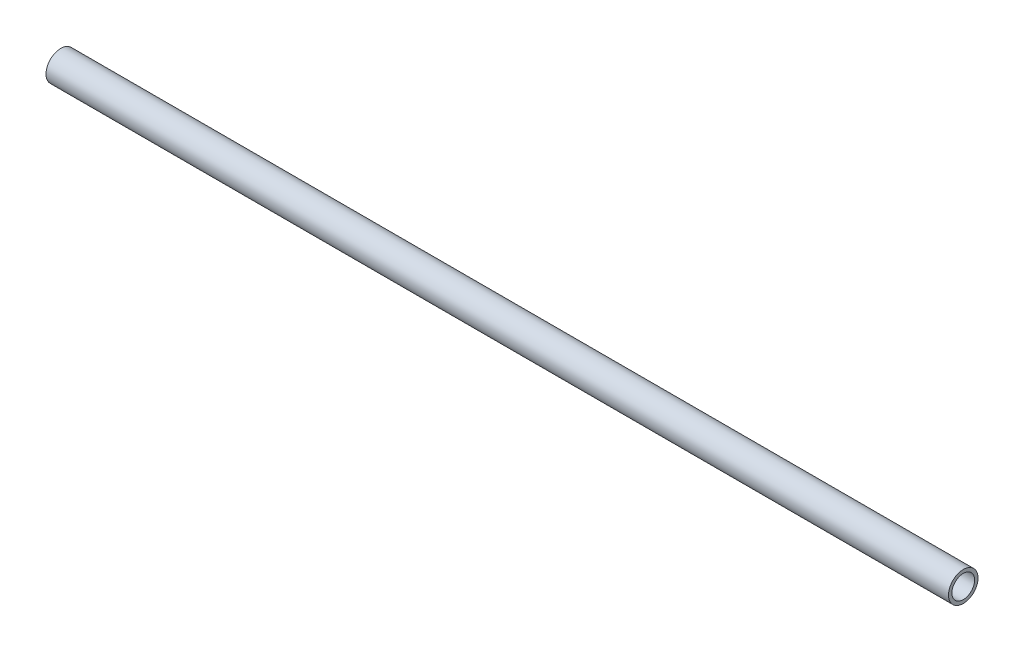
ISO-10303-21;
HEADER;
FILE_DESCRIPTION(('STEP AP214'),'2;1');
FILE_NAME('part.step','',(''),(''),'','','');
FILE_SCHEMA(('AUTOMOTIVE_DESIGN { 1 0 10303 214 1 1 1 1 }'));
ENDSEC;
DATA;
#1=APPLICATION_CONTEXT('core data for automotive mechanical design processes');
#2=APPLICATION_PROTOCOL_DEFINITION('international standard','automotive_design',2000,#1);
#3=PRODUCT_CONTEXT('',#1,'mechanical');
#4=PRODUCT('Part','Part','',(#3));
#5=PRODUCT_RELATED_PRODUCT_CATEGORY('part','',(#4));
#6=PRODUCT_DEFINITION_FORMATION('','',#4);
#7=PRODUCT_DEFINITION_CONTEXT('part definition',#1,'design');
#8=PRODUCT_DEFINITION('design','',#6,#7);
#9=PRODUCT_DEFINITION_SHAPE('','',#8);
#10=(LENGTH_UNIT() NAMED_UNIT(*) SI_UNIT(.MILLI.,.METRE.));
#11=(NAMED_UNIT(*) PLANE_ANGLE_UNIT() SI_UNIT($,.RADIAN.));
#12=(NAMED_UNIT(*) SI_UNIT($,.STERADIAN.) SOLID_ANGLE_UNIT());
#13=UNCERTAINTY_MEASURE_WITH_UNIT(LENGTH_MEASURE(1.E-05),#10,'distance_accuracy_value','');
#14=(GEOMETRIC_REPRESENTATION_CONTEXT(3) GLOBAL_UNCERTAINTY_ASSIGNED_CONTEXT((#13)) GLOBAL_UNIT_ASSIGNED_CONTEXT((#10,
#11,#12)) REPRESENTATION_CONTEXT('',''));
#15=CARTESIAN_POINT('',(0.,0.,0.));
#16=DIRECTION('',(0.,0.,1.));
#17=DIRECTION('',(1.,0.,0.));
#18=AXIS2_PLACEMENT_3D('',#15,#16,#17);
#19=CARTESIAN_POINT('',(1009.65,-5.55111512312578E-13,0.));
#20=DIRECTION('',(-0.999999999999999,0.,0.));
#21=DIRECTION('',(0.,0.,1.));
#22=AXIS2_PLACEMENT_3D('',#19,#20,#21);
#23=CYLINDRICAL_SURFACE('',#22,12.7);
#24=CARTESIAN_POINT('',(1009.65,-5.55111512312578E-13,0.));
#25=DIRECTION('',(0.999999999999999,0.,0.));
#26=DIRECTION('',(0.,0.,-1.));
#27=AXIS2_PLACEMENT_3D('',#24,#25,#26);
#28=CIRCLE('',#27,12.7);
#29=CARTESIAN_POINT('',(1009.65,-5.60046453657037E-13,12.7));
#30=VERTEX_POINT('',#29);
#31=EDGE_CURVE('E40',#30,#30,#28,.T.);
#32=CARTESIAN_POINT('',(0.,0.,0.));
#33=DIRECTION('',(0.999999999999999,0.,0.));
#34=DIRECTION('',(0.,0.,-1.));
#35=AXIS2_PLACEMENT_3D('',#32,#33,#34);
#36=CIRCLE('',#35,12.7);
#37=CARTESIAN_POINT('',(-2.22044604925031E-13,0.,12.7));
#38=VERTEX_POINT('',#37);
#39=EDGE_CURVE('E46',#38,#38,#36,.T.);
#40=CARTESIAN_POINT('',(1009.65,-5.60046453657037E-13,12.7));
#41=CARTESIAN_POINT('',(999.132812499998,-5.54149315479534E-13,12.7));
#42=CARTESIAN_POINT('',(988.615624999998,-5.48252177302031E-13,12.7));
#43=CARTESIAN_POINT('',(967.581249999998,-5.36457900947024E-13,12.7));
#44=CARTESIAN_POINT('',(957.064062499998,-5.30560762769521E-13,12.7));
#45=CARTESIAN_POINT('',(936.029687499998,-5.18766486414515E-13,12.7));
#46=CARTESIAN_POINT('',(925.512499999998,-5.12869348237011E-13,12.7));
#47=CARTESIAN_POINT('',(904.478124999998,-5.01075071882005E-13,12.7));
#48=CARTESIAN_POINT('',(893.960937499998,-4.95177933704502E-13,12.7));
#49=CARTESIAN_POINT('',(872.926562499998,-4.83383657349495E-13,12.7));
#50=CARTESIAN_POINT('',(862.409374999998,-4.77486519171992E-13,12.7));
#51=CARTESIAN_POINT('',(841.374999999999,-4.65692242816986E-13,12.7));
#52=CARTESIAN_POINT('',(830.857812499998,-4.59795104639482E-13,12.7));
#53=CARTESIAN_POINT('',(809.823437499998,-4.48000828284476E-13,12.7));
#54=CARTESIAN_POINT('',(799.306249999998,-4.42103690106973E-13,12.7));
#55=CARTESIAN_POINT('',(778.271874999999,-4.30309413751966E-13,12.7));
#56=CARTESIAN_POINT('',(767.754687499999,-4.24412275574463E-13,12.7));
#57=CARTESIAN_POINT('',(746.720312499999,-4.12617999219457E-13,12.7));
#58=CARTESIAN_POINT('',(736.203124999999,-4.06720861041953E-13,12.7));
#59=CARTESIAN_POINT('',(715.168749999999,-3.94926584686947E-13,12.7));
#60=CARTESIAN_POINT('',(704.651562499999,-3.89029446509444E-13,12.7));
#61=CARTESIAN_POINT('',(683.617187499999,-3.77235170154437E-13,12.7));
#62=CARTESIAN_POINT('',(673.099999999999,-3.71338031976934E-13,12.7));
#63=CARTESIAN_POINT('',(652.065624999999,-3.59543755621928E-13,12.7));
#64=CARTESIAN_POINT('',(641.548437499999,-3.53646617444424E-13,12.7));
#65=CARTESIAN_POINT('',(620.514062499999,-3.41852341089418E-13,12.7));
#66=CARTESIAN_POINT('',(609.996874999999,-3.35955202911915E-13,12.7));
#67=CARTESIAN_POINT('',(588.962499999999,-3.24160926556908E-13,12.7));
#68=CARTESIAN_POINT('',(578.445312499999,-3.18263788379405E-13,12.7));
#69=CARTESIAN_POINT('',(557.410937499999,-3.06469512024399E-13,12.7));
#70=CARTESIAN_POINT('',(546.893749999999,-3.00572373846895E-13,12.7));
#71=CARTESIAN_POINT('',(525.859374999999,-2.88778097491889E-13,12.7));
#72=CARTESIAN_POINT('',(515.342187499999,-2.82880959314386E-13,12.7));
#73=CARTESIAN_POINT('',(494.307812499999,-2.71086682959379E-13,12.7));
#74=CARTESIAN_POINT('',(483.790624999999,-2.65189544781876E-13,12.7));
#75=CARTESIAN_POINT('',(462.756249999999,-2.5339526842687E-13,12.7));
#76=CARTESIAN_POINT('',(452.239062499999,-2.47498130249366E-13,12.7));
#77=CARTESIAN_POINT('',(431.204687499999,-2.3570385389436E-13,12.7));
#78=CARTESIAN_POINT('',(420.687499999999,-2.29806715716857E-13,12.7));
#79=CARTESIAN_POINT('',(399.653124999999,-2.1801243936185E-13,12.7));
#80=CARTESIAN_POINT('',(389.135937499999,-2.12115301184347E-13,12.7));
#81=CARTESIAN_POINT('',(368.101562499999,-2.00321024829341E-13,12.7));
#82=CARTESIAN_POINT('',(357.584374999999,-1.94423886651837E-13,12.7));
#83=CARTESIAN_POINT('',(336.549999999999,-1.82629610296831E-13,12.7));
#84=CARTESIAN_POINT('',(326.032812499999,-1.76732472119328E-13,12.7));
#85=CARTESIAN_POINT('',(304.998437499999,-1.64938195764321E-13,12.7));
#86=CARTESIAN_POINT('',(294.481249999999,-1.59041057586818E-13,12.7));
#87=CARTESIAN_POINT('',(273.446874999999,-1.47246781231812E-13,12.7));
#88=CARTESIAN_POINT('',(262.929687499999,-1.41349643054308E-13,12.7));
#89=CARTESIAN_POINT('',(241.895312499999,-1.29555366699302E-13,12.7));
#90=CARTESIAN_POINT('',(231.378124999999,-1.23658228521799E-13,12.7));
#91=CARTESIAN_POINT('',(210.343749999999,-1.11863952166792E-13,12.7));
#92=CARTESIAN_POINT('',(199.826562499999,-1.05966813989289E-13,12.7));
#93=CARTESIAN_POINT('',(178.792187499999,0.,12.7));
#94=CARTESIAN_POINT('',(168.274999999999,0.,12.7));
#95=CARTESIAN_POINT('',(147.240624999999,0.,12.7));
#96=CARTESIAN_POINT('',(136.723437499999,0.,12.7));
#97=CARTESIAN_POINT('',(115.689062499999,0.,12.7));
#98=CARTESIAN_POINT('',(105.171874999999,0.,12.7));
#99=CARTESIAN_POINT('',(84.1374999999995,0.,12.7));
#100=CARTESIAN_POINT('',(73.6203124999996,0.,12.7));
#101=CARTESIAN_POINT('',(52.5859374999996,0.,12.7));
#102=CARTESIAN_POINT('',(42.0687499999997,0.,12.7));
#103=CARTESIAN_POINT('',(21.0343749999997,0.,12.7));
#104=CARTESIAN_POINT('',(10.5171874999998,0.,12.7));
#105=CARTESIAN_POINT('',(-2.22044604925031E-13,0.,12.7));
#106=B_SPLINE_CURVE_WITH_KNOTS('',3,(#40,#41,#42,#43,#44,#45,#46,#47,#48,#49,#50,#51,#52,#53,
#54,#55,#56,#57,#58,#59,#60,#61,#62,#63,#64,#65,#66,#67,#68,#69,#70,#71,#72,#73,#74,#75,#76,#77,
#78,#79,#80,#81,#82,#83,#84,#85,#86,#87,#88,#89,#90,#91,#92,#93,#94,#95,#96,#97,#98,#99,#100,
#101,#102,#103,#104,#105),.UNSPECIFIED.,.F.,.F.,(4,2,2,2,2,2,2,2,2,2,2,2,2,2,2,2,2,2,2,2,2,2,2,
2,2,2,2,2,2,2,2,2,4),(0.,31.5515625,63.103125,94.6546875,126.20625,157.7578125,189.309375,
220.8609375,252.4125,283.9640625,315.515625,347.0671875,378.61875,410.1703125,441.721875,
473.273437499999,504.824999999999,536.376562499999,567.928124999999,599.479687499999,
631.031249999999,662.582812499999,694.134374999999,725.685937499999,757.237499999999,
788.789062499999,820.340624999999,851.892187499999,883.443749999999,914.995312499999,
946.546874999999,978.098437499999,1009.65),.UNSPECIFIED.);
#107=EDGE_CURVE('BSEAM33',#30,#38,#106,.T.);
#108=ORIENTED_EDGE('',*,*,#31,.T.);
#109=ORIENTED_EDGE('',*,*,#39,.F.);
#110=ORIENTED_EDGE('',*,*,#107,.T.);
#111=ORIENTED_EDGE('',*,*,#107,.F.);
#112=EDGE_LOOP('',(#108,#110,#109,#111));
#113=FACE_BOUND('',#112,.T.);
#114=ADVANCED_FACE('F33',(#113),#23,.F.);
#115=CARTESIAN_POINT('',(1009.65,-5.55111512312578E-13,0.));
#116=DIRECTION('',(-0.999999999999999,0.,0.));
#117=DIRECTION('',(0.,0.,1.));
#118=AXIS2_PLACEMENT_3D('',#115,#116,#117);
#119=CYLINDRICAL_SURFACE('',#118,16.51);
#120=CARTESIAN_POINT('',(1009.65,-5.55111512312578E-13,0.));
#121=DIRECTION('',(0.999999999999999,0.,0.));
#122=DIRECTION('',(0.,0.,-1.));
#123=AXIS2_PLACEMENT_3D('',#120,#121,#122);
#124=CIRCLE('',#123,16.51);
#125=CARTESIAN_POINT('',(1009.65,-5.61526936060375E-13,16.51));
#126=VERTEX_POINT('',#125);
#127=EDGE_CURVE('E10',#126,#126,#124,.T.);
#128=CARTESIAN_POINT('',(0.,0.,0.));
#129=DIRECTION('',(0.999999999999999,0.,0.));
#130=DIRECTION('',(0.,0.,-1.));
#131=AXIS2_PLACEMENT_3D('',#128,#129,#130);
#132=CIRCLE('',#131,16.51);
#133=CARTESIAN_POINT('',(-2.22044604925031E-13,0.,16.51));
#134=VERTEX_POINT('',#133);
#135=EDGE_CURVE('E36',#134,#134,#132,.T.);
#136=CARTESIAN_POINT('',(1009.65,-5.61526936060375E-13,16.51));
#137=CARTESIAN_POINT('',(999.132812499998,-5.55629797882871E-13,16.51));
#138=CARTESIAN_POINT('',(988.615624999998,-5.49732659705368E-13,16.51));
#139=CARTESIAN_POINT('',(967.581249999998,-5.37938383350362E-13,16.51));
#140=CARTESIAN_POINT('',(957.064062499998,-5.32041245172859E-13,16.51));
#141=CARTESIAN_POINT('',(936.029687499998,-5.20246968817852E-13,16.51));
#142=CARTESIAN_POINT('',(925.512499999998,-5.14349830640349E-13,16.51));
#143=CARTESIAN_POINT('',(904.478124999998,-5.02555554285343E-13,16.51));
#144=CARTESIAN_POINT('',(893.960937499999,-4.96658416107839E-13,16.51));
#145=CARTESIAN_POINT('',(872.926562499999,-4.84864139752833E-13,16.51));
#146=CARTESIAN_POINT('',(862.409374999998,-4.7896700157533E-13,16.51));
#147=CARTESIAN_POINT('',(841.374999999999,-4.67172725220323E-13,16.51));
#148=CARTESIAN_POINT('',(830.857812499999,-4.6127558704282E-13,16.51));
#149=CARTESIAN_POINT('',(809.823437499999,-4.49481310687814E-13,16.51));
#150=CARTESIAN_POINT('',(799.306249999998,-4.4358417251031E-13,16.51));
#151=CARTESIAN_POINT('',(778.271874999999,-4.31789896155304E-13,16.51));
#152=CARTESIAN_POINT('',(767.754687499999,-4.25892757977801E-13,16.51));
#153=CARTESIAN_POINT('',(746.720312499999,-4.14098481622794E-13,16.51));
#154=CARTESIAN_POINT('',(736.203124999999,-4.08201343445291E-13,16.51));
#155=CARTESIAN_POINT('',(715.168749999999,-3.96407067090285E-13,16.51));
#156=CARTESIAN_POINT('',(704.651562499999,-3.90509928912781E-13,16.51));
#157=CARTESIAN_POINT('',(683.617187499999,-3.78715652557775E-13,16.51));
#158=CARTESIAN_POINT('',(673.099999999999,-3.72818514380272E-13,16.51));
#159=CARTESIAN_POINT('',(652.065624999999,-3.61024238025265E-13,16.51));
#160=CARTESIAN_POINT('',(641.548437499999,-3.55127099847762E-13,16.51));
#161=CARTESIAN_POINT('',(620.514062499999,-3.43332823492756E-13,16.51));
#162=CARTESIAN_POINT('',(609.996874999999,-3.37435685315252E-13,16.51));
#163=CARTESIAN_POINT('',(588.962499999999,-3.25641408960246E-13,16.51));
#164=CARTESIAN_POINT('',(578.445312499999,-3.19744270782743E-13,16.51));
#165=CARTESIAN_POINT('',(557.410937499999,-3.07949994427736E-13,16.51));
#166=CARTESIAN_POINT('',(546.893749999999,-3.02052856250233E-13,16.51));
#167=CARTESIAN_POINT('',(525.859374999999,-2.90258579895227E-13,16.51));
#168=CARTESIAN_POINT('',(515.342187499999,-2.84361441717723E-13,16.51));
#169=CARTESIAN_POINT('',(494.307812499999,-2.72567165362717E-13,16.51));
#170=CARTESIAN_POINT('',(483.790624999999,-2.66670027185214E-13,16.51));
#171=CARTESIAN_POINT('',(462.756249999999,-2.54875750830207E-13,16.51));
#172=CARTESIAN_POINT('',(452.239062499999,-2.48978612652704E-13,16.51));
#173=CARTESIAN_POINT('',(431.204687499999,-2.37184336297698E-13,16.51));
#174=CARTESIAN_POINT('',(420.687499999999,-2.31287198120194E-13,16.51));
#175=CARTESIAN_POINT('',(399.653124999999,-2.19492921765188E-13,16.51));
#176=CARTESIAN_POINT('',(389.135937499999,-2.13595783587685E-13,16.51));
#177=CARTESIAN_POINT('',(368.101562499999,-2.01801507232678E-13,16.51));
#178=CARTESIAN_POINT('',(357.584374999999,-1.95904369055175E-13,16.51));
#179=CARTESIAN_POINT('',(336.549999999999,-1.84110092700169E-13,16.51));
#180=CARTESIAN_POINT('',(326.032812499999,-1.78212954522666E-13,16.51));
#181=CARTESIAN_POINT('',(304.998437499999,-1.66418678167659E-13,16.51));
#182=CARTESIAN_POINT('',(294.481249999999,-1.60521539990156E-13,16.51));
#183=CARTESIAN_POINT('',(273.446874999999,-1.48727263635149E-13,16.51));
#184=CARTESIAN_POINT('',(262.929687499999,-1.42830125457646E-13,16.51));
#185=CARTESIAN_POINT('',(241.8953125,-1.3103584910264E-13,16.51));
#186=CARTESIAN_POINT('',(231.378125,-1.25138710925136E-13,16.51));
#187=CARTESIAN_POINT('',(210.34375,-1.1334443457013E-13,16.51));
#188=CARTESIAN_POINT('',(199.8265625,-1.07447296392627E-13,16.51));
#189=CARTESIAN_POINT('',(178.7921875,0.,16.51));
#190=CARTESIAN_POINT('',(168.275,0.,16.51));
#191=CARTESIAN_POINT('',(147.240625,0.,16.51));
#192=CARTESIAN_POINT('',(136.7234375,0.,16.51));
#193=CARTESIAN_POINT('',(115.6890625,0.,16.51));
#194=CARTESIAN_POINT('',(105.171875,0.,16.51));
#195=CARTESIAN_POINT('',(84.1374999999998,0.,16.51));
#196=CARTESIAN_POINT('',(73.6203124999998,0.,16.51));
#197=CARTESIAN_POINT('',(52.5859374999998,0.,16.51));
#198=CARTESIAN_POINT('',(42.0687499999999,0.,16.51));
#199=CARTESIAN_POINT('',(21.0343749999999,0.,16.51));
#200=CARTESIAN_POINT('',(10.5171874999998,0.,16.51));
#201=CARTESIAN_POINT('',(-2.22044604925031E-13,0.,16.51));
#202=B_SPLINE_CURVE_WITH_KNOTS('',3,(#136,#137,#138,#139,#140,#141,#142,#143,#144,#145,#146,
#147,#148,#149,#150,#151,#152,#153,#154,#155,#156,#157,#158,#159,#160,#161,#162,#163,#164,#165,
#166,#167,#168,#169,#170,#171,#172,#173,#174,#175,#176,#177,#178,#179,#180,#181,#182,#183,#184,
#185,#186,#187,#188,#189,#190,#191,#192,#193,#194,#195,#196,#197,#198,#199,#200,#201),
.UNSPECIFIED.,.F.,.F.,(4,2,2,2,2,2,2,2,2,2,2,2,2,2,2,2,2,2,2,2,2,2,2,2,2,2,2,2,2,2,2,2,4),(0.,
31.5515624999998,63.1031249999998,94.6546874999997,126.20625,157.7578125,189.309375,220.8609375,
252.412499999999,283.964062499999,315.515624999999,347.067187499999,378.618749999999,
410.170312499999,441.721874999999,473.273437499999,504.824999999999,536.376562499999,
567.928124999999,599.479687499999,631.031249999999,662.582812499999,694.134374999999,
725.685937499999,757.237499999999,788.789062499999,820.340624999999,851.892187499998,
883.443749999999,914.995312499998,946.546874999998,978.098437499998,1009.65),.UNSPECIFIED.);
#203=EDGE_CURVE('BSEAM53',#126,#134,#202,.T.);
#204=ORIENTED_EDGE('',*,*,#127,.F.);
#205=ORIENTED_EDGE('',*,*,#135,.T.);
#206=ORIENTED_EDGE('',*,*,#203,.T.);
#207=ORIENTED_EDGE('',*,*,#203,.F.);
#208=EDGE_LOOP('',(#204,#206,#205,#207));
#209=FACE_BOUND('',#208,.T.);
#210=ADVANCED_FACE('F53',(#209),#119,.T.);
#211=CARTESIAN_POINT('',(1009.65,-5.55111512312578E-13,0.));
#212=DIRECTION('',(0.999999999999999,0.,0.));
#213=DIRECTION('',(0.,0.,-1.));
#214=AXIS2_PLACEMENT_3D('',#211,#212,#213);
#215=PLANE('',#214);
#216=ORIENTED_EDGE('',*,*,#31,.F.);
#217=EDGE_LOOP('',(#216));
#218=FACE_BOUND('',#217,.T.);
#219=ORIENTED_EDGE('',*,*,#127,.T.);
#220=EDGE_LOOP('',(#219));
#221=FACE_BOUND('',#220,.T.);
#222=ADVANCED_FACE('F57',(#218,#221),#215,.T.);
#223=CARTESIAN_POINT('',(0.,0.,0.));
#224=DIRECTION('',(0.999999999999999,0.,0.));
#225=DIRECTION('',(0.,0.,-1.));
#226=AXIS2_PLACEMENT_3D('',#223,#224,#225);
#227=PLANE('',#226);
#228=ORIENTED_EDGE('',*,*,#39,.T.);
#229=EDGE_LOOP('',(#228));
#230=FACE_BOUND('',#229,.T.);
#231=ORIENTED_EDGE('',*,*,#135,.F.);
#232=EDGE_LOOP('',(#231));
#233=FACE_BOUND('',#232,.T.);
#234=ADVANCED_FACE('F55',(#230,#233),#227,.F.);
#235=CLOSED_SHELL('',(#114,#210,#222,#234));
#236=MANIFOLD_SOLID_BREP('B2',#235);
#237=ADVANCED_BREP_SHAPE_REPRESENTATION('',(#18,#236),#14);
#238=SHAPE_DEFINITION_REPRESENTATION(#9,#237);
ENDSEC;
END-ISO-10303-21;
